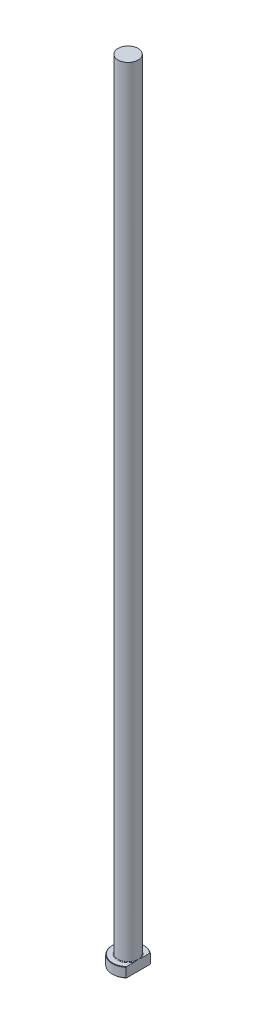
from build123d import *
from build123d.topology import SkipClean

# Parameters (mm, degrees)
CHAMFER1_SIZE = 0.2
FILLET1_R     = 0.3
KEY_DEPTH     = 401.159968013


with BuildPart() as part:
    # Sketch1 → Revolve1 (revolve)
    with BuildSketch(Plane.XY, mode=Mode.PRIVATE) as revolve1_sk:
        Polygon((0, 0), (-8, 0), (-8, 5), (-5.1, 5), (-5.1, 400), (0, 400), align=None)
    revolve(revolve1_sk.sketch.rotate(Axis((0, 259.958771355, 0), (0, -1, 0)), 270), axis=Axis((0, 259.958771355, 0), (0, -1, 0)))

    # Chamfer1
    chamfer1_edges = [part.edges().sort_by_distance(p)[0] for p in [
        (0, 5, -8),
        (0, 0, -8),
    ]]
    chamfer(chamfer1_edges, length=CHAMFER1_SIZE)

    # Fillet1
    fillet1_edges = [part.edges().sort_by_distance(p)[0] for p in [
        (0, 5, -5.1),
    ]]
    fillet(fillet1_edges, radius=FILLET1_R)

    # Sketch2 → KEY (cut, through all)
    with SkipClean():  # the faces are left unmerged after this step: merging them gives an invalid solid
        with BuildSketch(Plane(origin=(0, 0, 0), x_dir=(1, 0, 0), z_dir=(0, 1, 0))):
            with BuildLine():
                Line((5.1, 6.163602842), (5.1, -6.163602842))
                ThreePointArc((5.1, -6.163602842), (8, 0), (5.1, 6.163602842))
            make_face()
        extrude(amount=KEY_DEPTH, mode=Mode.SUBTRACT)


solid = part.part
